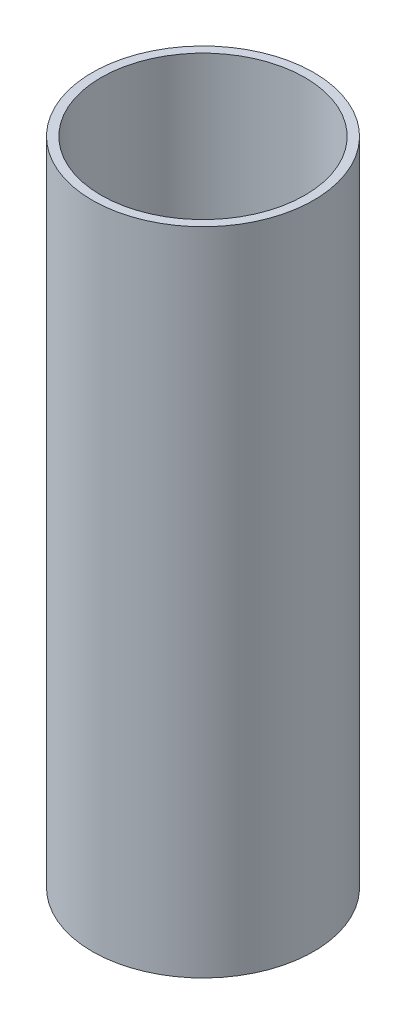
ISO-10303-21;
HEADER;
FILE_DESCRIPTION(('STEP AP214'),'2;1');
FILE_NAME('part.step','',(''),(''),'','','');
FILE_SCHEMA(('AUTOMOTIVE_DESIGN { 1 0 10303 214 1 1 1 1 }'));
ENDSEC;
DATA;
#1=APPLICATION_CONTEXT('core data for automotive mechanical design processes');
#2=APPLICATION_PROTOCOL_DEFINITION('international standard','automotive_design',2000,#1);
#3=PRODUCT_CONTEXT('',#1,'mechanical');
#4=PRODUCT('Part','Part','',(#3));
#5=PRODUCT_RELATED_PRODUCT_CATEGORY('part','',(#4));
#6=PRODUCT_DEFINITION_FORMATION('','',#4);
#7=PRODUCT_DEFINITION_CONTEXT('part definition',#1,'design');
#8=PRODUCT_DEFINITION('design','',#6,#7);
#9=PRODUCT_DEFINITION_SHAPE('','',#8);
#10=(LENGTH_UNIT() NAMED_UNIT(*) SI_UNIT(.MILLI.,.METRE.));
#11=(NAMED_UNIT(*) PLANE_ANGLE_UNIT() SI_UNIT($,.RADIAN.));
#12=(NAMED_UNIT(*) SI_UNIT($,.STERADIAN.) SOLID_ANGLE_UNIT());
#13=UNCERTAINTY_MEASURE_WITH_UNIT(LENGTH_MEASURE(1.E-05),#10,'distance_accuracy_value','');
#14=(GEOMETRIC_REPRESENTATION_CONTEXT(3) GLOBAL_UNCERTAINTY_ASSIGNED_CONTEXT((#13)) GLOBAL_UNIT_ASSIGNED_CONTEXT((#10,
#11,#12)) REPRESENTATION_CONTEXT('',''));
#15=CARTESIAN_POINT('',(0.,0.,0.));
#16=DIRECTION('',(0.,0.,1.));
#17=DIRECTION('',(1.,0.,0.));
#18=AXIS2_PLACEMENT_3D('',#15,#16,#17);
#19=CARTESIAN_POINT('',(0.,222.43542,0.));
#20=DIRECTION('',(0.,1.,0.));
#21=DIRECTION('',(0.,0.,1.));
#22=AXIS2_PLACEMENT_3D('',#19,#20,#21);
#23=PLANE('',#22);
#24=CARTESIAN_POINT('',(0.,222.43542,0.));
#25=DIRECTION('',(0.,1.,0.));
#26=DIRECTION('',(0.,0.,1.));
#27=AXIS2_PLACEMENT_3D('',#24,#25,#26);
#28=CIRCLE('',#27,37.846);
#29=CARTESIAN_POINT('',(0.,222.43542,37.846));
#30=VERTEX_POINT('',#29);
#31=EDGE_CURVE('E10',#30,#30,#28,.T.);
#32=ORIENTED_EDGE('',*,*,#31,.T.);
#33=EDGE_LOOP('',(#32));
#34=FACE_BOUND('',#33,.T.);
#35=CARTESIAN_POINT('',(0.,222.43542,0.));
#36=DIRECTION('',(0.,1.,0.));
#37=DIRECTION('',(0.,0.,1.));
#38=AXIS2_PLACEMENT_3D('',#35,#36,#37);
#39=CIRCLE('',#38,34.8615);
#40=CARTESIAN_POINT('',(0.,222.43542,34.8615));
#41=VERTEX_POINT('',#40);
#42=EDGE_CURVE('E58',#41,#41,#39,.T.);
#43=ORIENTED_EDGE('',*,*,#42,.F.);
#44=EDGE_LOOP('',(#43));
#45=FACE_BOUND('',#44,.T.);
#46=ADVANCED_FACE('F45',(#34,#45),#23,.T.);
#47=CARTESIAN_POINT('',(0.,0.,0.));
#48=DIRECTION('',(0.,1.,0.));
#49=DIRECTION('',(0.,0.,1.));
#50=AXIS2_PLACEMENT_3D('',#47,#48,#49);
#51=PLANE('',#50);
#52=CARTESIAN_POINT('',(0.,0.,0.));
#53=DIRECTION('',(0.,1.,0.));
#54=DIRECTION('',(0.,0.,1.));
#55=AXIS2_PLACEMENT_3D('',#52,#53,#54);
#56=CIRCLE('',#55,37.846);
#57=CARTESIAN_POINT('',(0.,0.,37.846));
#58=VERTEX_POINT('',#57);
#59=EDGE_CURVE('E49',#58,#58,#56,.T.);
#60=ORIENTED_EDGE('',*,*,#59,.F.);
#61=EDGE_LOOP('',(#60));
#62=FACE_BOUND('',#61,.T.);
#63=CARTESIAN_POINT('',(0.,0.,0.));
#64=DIRECTION('',(0.,1.,0.));
#65=DIRECTION('',(0.,0.,1.));
#66=AXIS2_PLACEMENT_3D('',#63,#64,#65);
#67=CIRCLE('',#66,34.8615);
#68=CARTESIAN_POINT('',(0.,0.,34.8615));
#69=VERTEX_POINT('',#68);
#70=EDGE_CURVE('E60',#69,#69,#67,.T.);
#71=ORIENTED_EDGE('',*,*,#70,.T.);
#72=EDGE_LOOP('',(#71));
#73=FACE_BOUND('',#72,.T.);
#74=ADVANCED_FACE('F72',(#62,#73),#51,.F.);
#75=CARTESIAN_POINT('',(0.,222.43542,0.));
#76=DIRECTION('',(0.,-1.,0.));
#77=DIRECTION('',(0.,0.,-1.));
#78=AXIS2_PLACEMENT_3D('',#75,#76,#77);
#79=CYLINDRICAL_SURFACE('',#78,37.846);
#80=ORIENTED_EDGE('',*,*,#31,.F.);
#81=EDGE_LOOP('',(#80));
#82=FACE_BOUND('',#81,.T.);
#83=ORIENTED_EDGE('',*,*,#59,.T.);
#84=EDGE_LOOP('',(#83));
#85=FACE_BOUND('',#84,.T.);
#86=ADVANCED_FACE('F47',(#82,#85),#79,.T.);
#87=CARTESIAN_POINT('',(0.,222.43542,0.));
#88=DIRECTION('',(0.,-1.,0.));
#89=DIRECTION('',(0.,0.,-1.));
#90=AXIS2_PLACEMENT_3D('',#87,#88,#89);
#91=CYLINDRICAL_SURFACE('',#90,34.8615);
#92=ORIENTED_EDGE('',*,*,#42,.T.);
#93=EDGE_LOOP('',(#92));
#94=FACE_BOUND('',#93,.T.);
#95=ORIENTED_EDGE('',*,*,#70,.F.);
#96=EDGE_LOOP('',(#95));
#97=FACE_BOUND('',#96,.T.);
#98=ADVANCED_FACE('F68',(#94,#97),#91,.F.);
#99=CLOSED_SHELL('',(#46,#74,#86,#98));
#100=MANIFOLD_SOLID_BREP('B2',#99);
#101=ADVANCED_BREP_SHAPE_REPRESENTATION('',(#18,#100),#14);
#102=SHAPE_DEFINITION_REPRESENTATION(#9,#101);
ENDSEC;
END-ISO-10303-21;
